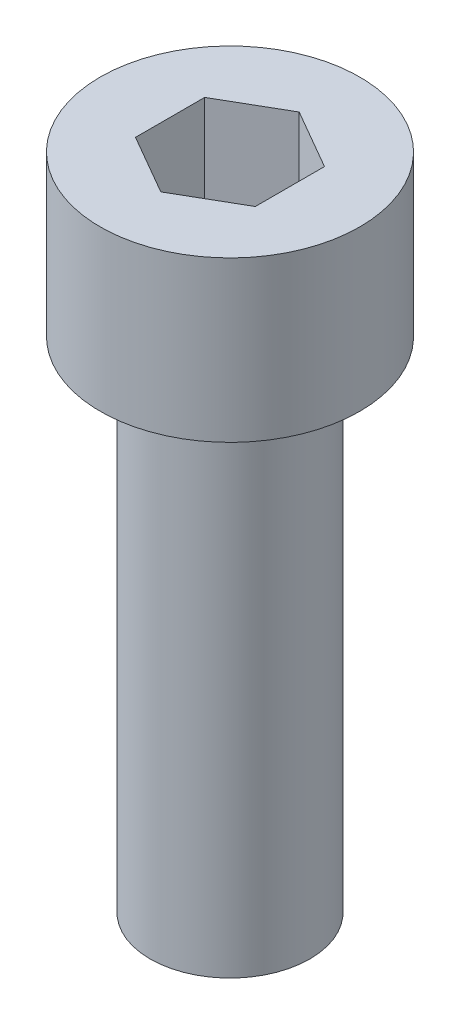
ISO-10303-21;
HEADER;
FILE_DESCRIPTION(('STEP AP214'),'2;1');
FILE_NAME('part.step','',(''),(''),'','','');
FILE_SCHEMA(('AUTOMOTIVE_DESIGN { 1 0 10303 214 1 1 1 1 }'));
ENDSEC;
DATA;
#1=APPLICATION_CONTEXT('core data for automotive mechanical design processes');
#2=APPLICATION_PROTOCOL_DEFINITION('international standard','automotive_design',2000,#1);
#3=PRODUCT_CONTEXT('',#1,'mechanical');
#4=PRODUCT('Part','Part','',(#3));
#5=PRODUCT_RELATED_PRODUCT_CATEGORY('part','',(#4));
#6=PRODUCT_DEFINITION_FORMATION('','',#4);
#7=PRODUCT_DEFINITION_CONTEXT('part definition',#1,'design');
#8=PRODUCT_DEFINITION('design','',#6,#7);
#9=PRODUCT_DEFINITION_SHAPE('','',#8);
#10=(LENGTH_UNIT() NAMED_UNIT(*) SI_UNIT(.MILLI.,.METRE.));
#11=(NAMED_UNIT(*) PLANE_ANGLE_UNIT() SI_UNIT($,.RADIAN.));
#12=(NAMED_UNIT(*) SI_UNIT($,.STERADIAN.) SOLID_ANGLE_UNIT());
#13=UNCERTAINTY_MEASURE_WITH_UNIT(LENGTH_MEASURE(1.E-05),#10,'distance_accuracy_value','');
#14=(GEOMETRIC_REPRESENTATION_CONTEXT(3) GLOBAL_UNCERTAINTY_ASSIGNED_CONTEXT((#13)) GLOBAL_UNIT_ASSIGNED_CONTEXT((#10,
#11,#12)) REPRESENTATION_CONTEXT('',''));
#15=CARTESIAN_POINT('',(0.,0.,0.));
#16=DIRECTION('',(0.,0.,1.));
#17=DIRECTION('',(1.,0.,0.));
#18=AXIS2_PLACEMENT_3D('',#15,#16,#17);
#19=CARTESIAN_POINT('',(0.,-25.,-2.4980018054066E-13));
#20=DIRECTION('',(0.,1.,0.));
#21=DIRECTION('',(-1.,0.,0.));
#22=AXIS2_PLACEMENT_3D('',#19,#20,#21);
#23=PLANE('',#22);
#24=CARTESIAN_POINT('',(0.,-25.,0.));
#25=DIRECTION('',(0.,1.,0.));
#26=DIRECTION('',(-1.,0.,0.));
#27=AXIS2_PLACEMENT_3D('',#24,#25,#26);
#28=CIRCLE('',#27,4.);
#29=CARTESIAN_POINT('',(-4.,-25.,0.));
#30=VERTEX_POINT('',#29);
#31=EDGE_CURVE('E10',#30,#30,#28,.T.);
#32=ORIENTED_EDGE('',*,*,#31,.F.);
#33=EDGE_LOOP('',(#32));
#34=FACE_BOUND('',#33,.T.);
#35=ADVANCED_FACE('F16',(#34),#23,.F.);
#36=CARTESIAN_POINT('',(0.,0.,0.));
#37=DIRECTION('',(0.,1.,0.));
#38=DIRECTION('',(-1.,0.,0.));
#39=AXIS2_PLACEMENT_3D('',#36,#37,#38);
#40=CYLINDRICAL_SURFACE('',#39,4.);
#41=CARTESIAN_POINT('',(0.,0.,0.));
#42=DIRECTION('',(0.,1.,0.));
#43=DIRECTION('',(-1.,0.,0.));
#44=AXIS2_PLACEMENT_3D('',#41,#42,#43);
#45=CIRCLE('',#44,4.);
#46=CARTESIAN_POINT('',(-4.,0.,0.));
#47=VERTEX_POINT('',#46);
#48=EDGE_CURVE('E25',#47,#47,#45,.F.);
#49=ORIENTED_EDGE('',*,*,#48,.T.);
#50=EDGE_LOOP('',(#49));
#51=FACE_BOUND('',#50,.T.);
#52=ORIENTED_EDGE('',*,*,#31,.T.);
#53=EDGE_LOOP('',(#52));
#54=FACE_BOUND('',#53,.T.);
#55=ADVANCED_FACE('F18',(#51,#54),#40,.T.);
#56=CARTESIAN_POINT('',(2.99999999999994,2.32000000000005,-5.19615242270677));
#57=DIRECTION('',(0.,-1.,0.));
#58=DIRECTION('',(1.,0.,0.));
#59=AXIS2_PLACEMENT_3D('',#56,#57,#58);
#60=PLANE('',#59);
#61=DIRECTION('',(0.866025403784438,0.,0.5));
#62=VECTOR('',#61,1.);
#63=CARTESIAN_POINT('',(-3.,2.32,1.73205080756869));
#64=LINE('',#63,#62);
#65=CARTESIAN_POINT('',(-3.,2.32,1.73205080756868));
#66=VERTEX_POINT('',#65);
#67=CARTESIAN_POINT('',(0.,2.32,3.46410161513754));
#68=VERTEX_POINT('',#67);
#69=EDGE_CURVE('E90',#66,#68,#64,.T.);
#70=ORIENTED_EDGE('',*,*,#69,.T.);
#71=DIRECTION('',(-0.866025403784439,0.,0.5));
#72=VECTOR('',#71,1.);
#73=CARTESIAN_POINT('',(3.,2.32,1.73205080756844));
#74=LINE('',#73,#72);
#75=CARTESIAN_POINT('',(2.9999999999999,2.32,1.73205080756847));
#76=VERTEX_POINT('',#75);
#77=EDGE_CURVE('E129',#76,#68,#74,.T.);
#78=ORIENTED_EDGE('',*,*,#77,.F.);
#79=DIRECTION('',(0.,0.,1.));
#80=VECTOR('',#79,1.);
#81=CARTESIAN_POINT('',(2.99999999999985,2.31999999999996,-1.73205080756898));
#82=LINE('',#81,#80);
#83=CARTESIAN_POINT('',(2.99999999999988,2.32,-1.73205080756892));
#84=VERTEX_POINT('',#83);
#85=EDGE_CURVE('E123',#84,#76,#82,.T.);
#86=ORIENTED_EDGE('',*,*,#85,.F.);
#87=DIRECTION('',(-0.866025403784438,0.,-0.5));
#88=VECTOR('',#87,1.);
#89=CARTESIAN_POINT('',(2.99999999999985,2.31999999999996,-1.73205080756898));
#90=LINE('',#89,#88);
#91=CARTESIAN_POINT('',(-1.09423104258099E-13,2.32,-3.46410161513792));
#92=VERTEX_POINT('',#91);
#93=EDGE_CURVE('E73',#84,#92,#90,.T.);
#94=ORIENTED_EDGE('',*,*,#93,.T.);
#95=DIRECTION('',(0.866025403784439,0.,-0.5));
#96=VECTOR('',#95,1.);
#97=CARTESIAN_POINT('',(-3.,2.32,-1.73205080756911));
#98=LINE('',#97,#96);
#99=CARTESIAN_POINT('',(-3.,2.32,-1.73205080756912));
#100=VERTEX_POINT('',#99);
#101=EDGE_CURVE('E69',#100,#92,#98,.T.);
#102=ORIENTED_EDGE('',*,*,#101,.F.);
#103=DIRECTION('',(0.,0.,1.));
#104=VECTOR('',#103,1.);
#105=CARTESIAN_POINT('',(-3.,2.32,-1.73205080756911));
#106=LINE('',#105,#104);
#107=EDGE_CURVE('E66',#100,#66,#106,.T.);
#108=ORIENTED_EDGE('',*,*,#107,.T.);
#109=EDGE_LOOP('',(#70,#78,#86,#94,#102,#108));
#110=FACE_BOUND('',#109,.T.);
#111=ADVANCED_FACE('F71',(#110),#60,.F.);
#112=CARTESIAN_POINT('',(-3.,2.32,-1.73205080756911));
#113=DIRECTION('',(0.5,0.,0.866025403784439));
#114=DIRECTION('',(0.866025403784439,0.,-0.5));
#115=AXIS2_PLACEMENT_3D('',#112,#113,#114);
#116=PLANE('',#115);
#117=DIRECTION('',(-0.866025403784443,0.,0.499999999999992));
#118=VECTOR('',#117,1.);
#119=CARTESIAN_POINT('',(0.,8.0000000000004,-3.46410161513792));
#120=LINE('',#119,#118);
#121=CARTESIAN_POINT('',(-1.11006073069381E-13,8.0000000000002,-3.46410161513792));
#122=VERTEX_POINT('',#121);
#123=CARTESIAN_POINT('',(-3.,8.0000000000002,-1.73205080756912));
#124=VERTEX_POINT('',#123);
#125=EDGE_CURVE('E81',#122,#124,#120,.T.);
#126=ORIENTED_EDGE('',*,*,#125,.T.);
#127=DIRECTION('',(0.,1.,0.));
#128=VECTOR('',#127,1.);
#129=CARTESIAN_POINT('',(-3.,2.32,-1.73205080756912));
#130=LINE('',#129,#128);
#131=EDGE_CURVE('E76',#124,#100,#130,.F.);
#132=ORIENTED_EDGE('',*,*,#131,.T.);
#133=ORIENTED_EDGE('',*,*,#101,.T.);
#134=DIRECTION('',(0.,1.,0.));
#135=VECTOR('',#134,1.);
#136=CARTESIAN_POINT('',(-1.42681005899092E-13,2.31999999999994,-3.46410161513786));
#137=LINE('',#136,#135);
#138=EDGE_CURVE('E116',#92,#122,#137,.T.);
#139=ORIENTED_EDGE('',*,*,#138,.T.);
#140=EDGE_LOOP('',(#126,#132,#133,#139));
#141=FACE_BOUND('',#140,.T.);
#142=ADVANCED_FACE('F79',(#141),#116,.T.);
#143=CARTESIAN_POINT('',(-3.,2.32,-1.73205080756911));
#144=DIRECTION('',(-1.,0.,0.));
#145=DIRECTION('',(0.,0.,1.));
#146=AXIS2_PLACEMENT_3D('',#143,#144,#145);
#147=PLANE('',#146);
#148=ORIENTED_EDGE('',*,*,#107,.F.);
#149=ORIENTED_EDGE('',*,*,#131,.F.);
#150=DIRECTION('',(0.,0.,1.));
#151=VECTOR('',#150,1.);
#152=CARTESIAN_POINT('',(-3.,8.00000000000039,-1.80411241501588E-13));
#153=LINE('',#152,#151);
#154=CARTESIAN_POINT('',(-3.,8.00000000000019,1.73205080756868));
#155=VERTEX_POINT('',#154);
#156=EDGE_CURVE('E113',#124,#155,#153,.T.);
#157=ORIENTED_EDGE('',*,*,#156,.T.);
#158=DIRECTION('',(0.,1.,0.));
#159=VECTOR('',#158,1.);
#160=CARTESIAN_POINT('',(-3.,2.31999999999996,1.73205080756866));
#161=LINE('',#160,#159);
#162=EDGE_CURVE('E87',#155,#66,#161,.F.);
#163=ORIENTED_EDGE('',*,*,#162,.T.);
#164=EDGE_LOOP('',(#148,#149,#157,#163));
#165=FACE_BOUND('',#164,.T.);
#166=ADVANCED_FACE('F85',(#165),#147,.F.);
#167=CARTESIAN_POINT('',(-3.,2.31999999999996,1.73205080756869));
#168=DIRECTION('',(-0.5,0.,0.866025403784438));
#169=DIRECTION('',(0.866025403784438,0.,0.5));
#170=AXIS2_PLACEMENT_3D('',#167,#168,#169);
#171=PLANE('',#170);
#172=ORIENTED_EDGE('',*,*,#69,.F.);
#173=ORIENTED_EDGE('',*,*,#162,.F.);
#174=DIRECTION('',(0.866025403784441,0.,0.5));
#175=VECTOR('',#174,1.);
#176=CARTESIAN_POINT('',(-3.,8.00000000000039,1.73205080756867));
#177=LINE('',#176,#175);
#178=CARTESIAN_POINT('',(0.,8.00000000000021,3.46410161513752));
#179=VERTEX_POINT('',#178);
#180=EDGE_CURVE('E111',#155,#179,#177,.T.);
#181=ORIENTED_EDGE('',*,*,#180,.T.);
#182=DIRECTION('',(0.,1.,0.));
#183=VECTOR('',#182,1.);
#184=CARTESIAN_POINT('',(-1.29670579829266E-13,2.32,3.46410161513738));
#185=LINE('',#184,#183);
#186=EDGE_CURVE('E126',#68,#179,#185,.T.);
#187=ORIENTED_EDGE('',*,*,#186,.F.);
#188=EDGE_LOOP('',(#172,#173,#181,#187));
#189=FACE_BOUND('',#188,.T.);
#190=ADVANCED_FACE('F134',(#189),#171,.F.);
#191=CARTESIAN_POINT('',(3.,2.32,1.73205080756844));
#192=DIRECTION('',(-0.5,0.,-0.866025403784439));
#193=DIRECTION('',(-0.866025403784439,0.,0.5));
#194=AXIS2_PLACEMENT_3D('',#191,#192,#193);
#195=PLANE('',#194);
#196=DIRECTION('',(0.866025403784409,0.,-0.500000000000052));
#197=VECTOR('',#196,1.);
#198=CARTESIAN_POINT('',(0.,8.0000000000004,3.46410161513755));
#199=LINE('',#198,#197);
#200=CARTESIAN_POINT('',(2.99999999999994,8.00000000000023,1.73205080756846));
#201=VERTEX_POINT('',#200);
#202=EDGE_CURVE('E107',#179,#201,#199,.T.);
#203=ORIENTED_EDGE('',*,*,#202,.T.);
#204=DIRECTION('',(0.,1.,0.));
#205=VECTOR('',#204,1.);
#206=CARTESIAN_POINT('',(2.99999999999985,2.31999999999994,1.73205080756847));
#207=LINE('',#206,#205);
#208=EDGE_CURVE('E121',#76,#201,#207,.T.);
#209=ORIENTED_EDGE('',*,*,#208,.F.);
#210=ORIENTED_EDGE('',*,*,#77,.T.);
#211=ORIENTED_EDGE('',*,*,#186,.T.);
#212=EDGE_LOOP('',(#203,#209,#210,#211));
#213=FACE_BOUND('',#212,.T.);
#214=ADVANCED_FACE('F138',(#213),#195,.T.);
#215=CARTESIAN_POINT('',(2.99999999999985,2.31999999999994,-1.73205080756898));
#216=DIRECTION('',(-1.,0.,0.));
#217=DIRECTION('',(0.,0.,1.));
#218=AXIS2_PLACEMENT_3D('',#215,#216,#217);
#219=PLANE('',#218);
#220=DIRECTION('',(0.,0.,1.));
#221=VECTOR('',#220,1.);
#222=CARTESIAN_POINT('',(3.,8.0000000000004,-1.80411241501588E-13));
#223=LINE('',#222,#221);
#224=CARTESIAN_POINT('',(2.9999999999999,8.00000000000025,-1.73205080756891));
#225=VERTEX_POINT('',#224);
#226=EDGE_CURVE('E33',#201,#225,#223,.F.);
#227=ORIENTED_EDGE('',*,*,#226,.T.);
#228=DIRECTION('',(0.,1.,0.));
#229=VECTOR('',#228,1.);
#230=CARTESIAN_POINT('',(2.99999999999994,2.31999999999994,-1.73205080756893));
#231=LINE('',#230,#229);
#232=EDGE_CURVE('E119',#225,#84,#231,.F.);
#233=ORIENTED_EDGE('',*,*,#232,.T.);
#234=ORIENTED_EDGE('',*,*,#85,.T.);
#235=ORIENTED_EDGE('',*,*,#208,.T.);
#236=EDGE_LOOP('',(#227,#233,#234,#235));
#237=FACE_BOUND('',#236,.T.);
#238=ADVANCED_FACE('F139',(#237),#219,.T.);
#239=CARTESIAN_POINT('',(2.99999999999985,2.31999999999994,-1.73205080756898));
#240=DIRECTION('',(0.5,0.,-0.866025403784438));
#241=DIRECTION('',(-0.866025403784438,0.,-0.5));
#242=AXIS2_PLACEMENT_3D('',#239,#240,#241);
#243=PLANE('',#242);
#244=ORIENTED_EDGE('',*,*,#93,.F.);
#245=ORIENTED_EDGE('',*,*,#232,.F.);
#246=DIRECTION('',(-0.866025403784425,0.,-0.500000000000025));
#247=VECTOR('',#246,1.);
#248=CARTESIAN_POINT('',(2.99999999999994,8.0000000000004,-1.73205080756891));
#249=LINE('',#248,#247);
#250=EDGE_CURVE('E100',#225,#122,#249,.T.);
#251=ORIENTED_EDGE('',*,*,#250,.T.);
#252=ORIENTED_EDGE('',*,*,#138,.F.);
#253=EDGE_LOOP('',(#244,#245,#251,#252));
#254=FACE_BOUND('',#253,.T.);
#255=ADVANCED_FACE('F140',(#254),#243,.F.);
#256=CARTESIAN_POINT('',(6.1,8.0000000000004,-1.80411241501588E-13));
#257=DIRECTION('',(0.,-1.,0.));
#258=DIRECTION('',(1.,0.,0.));
#259=AXIS2_PLACEMENT_3D('',#256,#257,#258);
#260=PLANE('',#259);
#261=CARTESIAN_POINT('',(0.,8.0000000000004,0.));
#262=DIRECTION('',(0.,-1.,0.));
#263=DIRECTION('',(1.,0.,0.));
#264=AXIS2_PLACEMENT_3D('',#261,#262,#263);
#265=CIRCLE('',#264,6.5);
#266=CARTESIAN_POINT('',(6.5,8.0000000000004,0.));
#267=VERTEX_POINT('',#266);
#268=EDGE_CURVE('E98',#267,#267,#265,.T.);
#269=ORIENTED_EDGE('',*,*,#268,.F.);
#270=EDGE_LOOP('',(#269));
#271=FACE_BOUND('',#270,.T.);
#272=ORIENTED_EDGE('',*,*,#226,.F.);
#273=ORIENTED_EDGE('',*,*,#202,.F.);
#274=ORIENTED_EDGE('',*,*,#180,.F.);
#275=ORIENTED_EDGE('',*,*,#156,.F.);
#276=ORIENTED_EDGE('',*,*,#125,.F.);
#277=ORIENTED_EDGE('',*,*,#250,.F.);
#278=EDGE_LOOP('',(#272,#273,#274,#275,#276,#277));
#279=FACE_BOUND('',#278,.T.);
#280=ADVANCED_FACE('F142',(#271,#279),#260,.F.);
#281=CARTESIAN_POINT('',(0.,0.,0.));
#282=DIRECTION('',(0.,1.,0.));
#283=DIRECTION('',(-1.,0.,0.));
#284=AXIS2_PLACEMENT_3D('',#281,#282,#283);
#285=CYLINDRICAL_SURFACE('',#284,6.5);
#286=ORIENTED_EDGE('',*,*,#268,.T.);
#287=EDGE_LOOP('',(#286));
#288=FACE_BOUND('',#287,.T.);
#289=CARTESIAN_POINT('',(0.,0.,0.));
#290=DIRECTION('',(0.,1.,0.));
#291=DIRECTION('',(-1.,0.,0.));
#292=AXIS2_PLACEMENT_3D('',#289,#290,#291);
#293=CIRCLE('',#292,6.5);
#294=CARTESIAN_POINT('',(-6.5,0.,0.));
#295=VERTEX_POINT('',#294);
#296=EDGE_CURVE('E96',#295,#295,#293,.T.);
#297=ORIENTED_EDGE('',*,*,#296,.T.);
#298=EDGE_LOOP('',(#297));
#299=FACE_BOUND('',#298,.T.);
#300=ADVANCED_FACE('F150',(#288,#299),#285,.T.);
#301=CARTESIAN_POINT('',(4.,0.,-2.77555756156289E-13));
#302=DIRECTION('',(0.,1.,0.));
#303=DIRECTION('',(-1.,0.,0.));
#304=AXIS2_PLACEMENT_3D('',#301,#302,#303);
#305=PLANE('',#304);
#306=ORIENTED_EDGE('',*,*,#296,.F.);
#307=EDGE_LOOP('',(#306));
#308=FACE_BOUND('',#307,.T.);
#309=ORIENTED_EDGE('',*,*,#48,.F.);
#310=EDGE_LOOP('',(#309));
#311=FACE_BOUND('',#310,.T.);
#312=ADVANCED_FACE('F161',(#308,#311),#305,.F.);
#313=CLOSED_SHELL('',(#35,#55,#111,#142,#166,#190,#214,#238,#255,#280,#300,#312));
#314=MANIFOLD_SOLID_BREP('B1',#313);
#315=ADVANCED_BREP_SHAPE_REPRESENTATION('',(#18,#314),#14);
#316=SHAPE_DEFINITION_REPRESENTATION(#9,#315);
ENDSEC;
END-ISO-10303-21;
